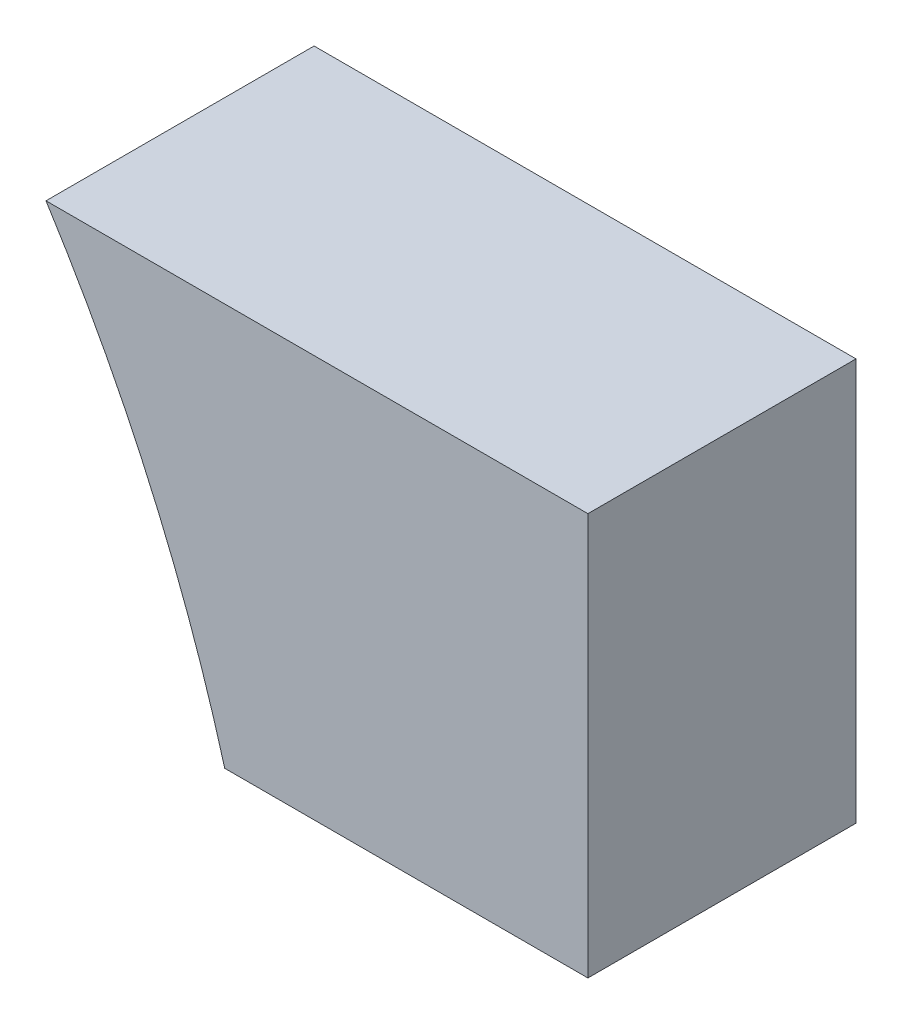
ISO-10303-21;
HEADER;
FILE_DESCRIPTION(('STEP AP214'),'2;1');
FILE_NAME('part.step','',(''),(''),'','','');
FILE_SCHEMA(('AUTOMOTIVE_DESIGN { 1 0 10303 214 1 1 1 1 }'));
ENDSEC;
DATA;
#1=APPLICATION_CONTEXT('core data for automotive mechanical design processes');
#2=APPLICATION_PROTOCOL_DEFINITION('international standard','automotive_design',2000,#1);
#3=PRODUCT_CONTEXT('',#1,'mechanical');
#4=PRODUCT('Part','Part','',(#3));
#5=PRODUCT_RELATED_PRODUCT_CATEGORY('part','',(#4));
#6=PRODUCT_DEFINITION_FORMATION('','',#4);
#7=PRODUCT_DEFINITION_CONTEXT('part definition',#1,'design');
#8=PRODUCT_DEFINITION('design','',#6,#7);
#9=PRODUCT_DEFINITION_SHAPE('','',#8);
#10=(LENGTH_UNIT() NAMED_UNIT(*) SI_UNIT(.MILLI.,.METRE.));
#11=(NAMED_UNIT(*) PLANE_ANGLE_UNIT() SI_UNIT($,.RADIAN.));
#12=(NAMED_UNIT(*) SI_UNIT($,.STERADIAN.) SOLID_ANGLE_UNIT());
#13=UNCERTAINTY_MEASURE_WITH_UNIT(LENGTH_MEASURE(1.E-05),#10,'distance_accuracy_value','');
#14=(GEOMETRIC_REPRESENTATION_CONTEXT(3) GLOBAL_UNCERTAINTY_ASSIGNED_CONTEXT((#13)) GLOBAL_UNIT_ASSIGNED_CONTEXT((#10,
#11,#12)) REPRESENTATION_CONTEXT('',''));
#15=CARTESIAN_POINT('',(0.,0.,0.));
#16=DIRECTION('',(0.,0.,1.));
#17=DIRECTION('',(1.,0.,0.));
#18=AXIS2_PLACEMENT_3D('',#15,#16,#17);
#19=CARTESIAN_POINT('',(0.,0.,20.));
#20=DIRECTION('',(0.,0.,-1.));
#21=DIRECTION('',(-1.,0.,0.));
#22=AXIS2_PLACEMENT_3D('',#19,#20,#21);
#23=CYLINDRICAL_SURFACE('',#22,112.);
#24=CARTESIAN_POINT('',(0.,0.,0.));
#25=DIRECTION('',(0.,0.,-1.));
#26=DIRECTION('',(1.,0.,0.));
#27=AXIS2_PLACEMENT_3D('',#24,#25,#26);
#28=CIRCLE('',#27,112.);
#29=CARTESIAN_POINT('',(94.5727233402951,60.,0.));
#30=VERTEX_POINT('',#29);
#31=CARTESIAN_POINT('',(107.90736768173,30.,0.));
#32=VERTEX_POINT('',#31);
#33=EDGE_CURVE('E70',#30,#32,#28,.T.);
#34=ORIENTED_EDGE('',*,*,#33,.T.);
#35=DIRECTION('',(0.,0.,-1.));
#36=VECTOR('',#35,1.);
#37=CARTESIAN_POINT('',(107.90736768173,30.,20.));
#38=LINE('',#37,#36);
#39=CARTESIAN_POINT('',(107.90736768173,30.,20.));
#40=VERTEX_POINT('',#39);
#41=EDGE_CURVE('E11',#40,#32,#38,.T.);
#42=ORIENTED_EDGE('',*,*,#41,.F.);
#43=CARTESIAN_POINT('',(0.,0.,20.));
#44=DIRECTION('',(0.,0.,-1.));
#45=DIRECTION('',(1.,0.,0.));
#46=AXIS2_PLACEMENT_3D('',#43,#44,#45);
#47=CIRCLE('',#46,112.);
#48=CARTESIAN_POINT('',(94.5727233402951,60.,20.));
#49=VERTEX_POINT('',#48);
#50=EDGE_CURVE('E88',#49,#40,#47,.T.);
#51=ORIENTED_EDGE('',*,*,#50,.F.);
#52=DIRECTION('',(0.,0.,-1.));
#53=VECTOR('',#52,1.);
#54=CARTESIAN_POINT('',(94.5727233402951,60.,20.));
#55=LINE('',#54,#53);
#56=EDGE_CURVE('E82',#49,#30,#55,.T.);
#57=ORIENTED_EDGE('',*,*,#56,.T.);
#58=EDGE_LOOP('',(#34,#42,#51,#57));
#59=FACE_BOUND('',#58,.T.);
#60=ADVANCED_FACE('F26',(#59),#23,.F.);
#61=CARTESIAN_POINT('',(135.,30.,20.));
#62=DIRECTION('',(0.,1.,0.));
#63=DIRECTION('',(-1.,0.,0.));
#64=AXIS2_PLACEMENT_3D('',#61,#62,#63);
#65=PLANE('',#64);
#66=DIRECTION('',(1.,0.,0.));
#67=VECTOR('',#66,1.);
#68=CARTESIAN_POINT('',(135.,30.,0.));
#69=LINE('',#68,#67);
#70=CARTESIAN_POINT('',(135.,30.,0.));
#71=VERTEX_POINT('',#70);
#72=EDGE_CURVE('E66',#32,#71,#69,.T.);
#73=ORIENTED_EDGE('',*,*,#72,.T.);
#74=DIRECTION('',(0.,0.,-1.));
#75=VECTOR('',#74,1.);
#76=CARTESIAN_POINT('',(135.,30.,20.));
#77=LINE('',#76,#75);
#78=CARTESIAN_POINT('',(135.,30.,20.));
#79=VERTEX_POINT('',#78);
#80=EDGE_CURVE('E33',#79,#71,#77,.T.);
#81=ORIENTED_EDGE('',*,*,#80,.F.);
#82=DIRECTION('',(1.,0.,0.));
#83=VECTOR('',#82,1.);
#84=CARTESIAN_POINT('',(135.,30.,20.));
#85=LINE('',#84,#83);
#86=EDGE_CURVE('E78',#40,#79,#85,.T.);
#87=ORIENTED_EDGE('',*,*,#86,.F.);
#88=ORIENTED_EDGE('',*,*,#41,.T.);
#89=EDGE_LOOP('',(#73,#81,#87,#88));
#90=FACE_BOUND('',#89,.T.);
#91=ADVANCED_FACE('F77',(#90),#65,.F.);
#92=CARTESIAN_POINT('',(135.,60.,20.));
#93=DIRECTION('',(-1.,0.,0.));
#94=DIRECTION('',(0.,0.,1.));
#95=AXIS2_PLACEMENT_3D('',#92,#93,#94);
#96=PLANE('',#95);
#97=DIRECTION('',(0.,1.,0.));
#98=VECTOR('',#97,1.);
#99=CARTESIAN_POINT('',(135.,60.,0.));
#100=LINE('',#99,#98);
#101=CARTESIAN_POINT('',(135.,60.,0.));
#102=VERTEX_POINT('',#101);
#103=EDGE_CURVE('E71',#71,#102,#100,.T.);
#104=ORIENTED_EDGE('',*,*,#103,.T.);
#105=DIRECTION('',(0.,0.,-1.));
#106=VECTOR('',#105,1.);
#107=CARTESIAN_POINT('',(135.,60.,20.));
#108=LINE('',#107,#106);
#109=CARTESIAN_POINT('',(135.,60.,20.));
#110=VERTEX_POINT('',#109);
#111=EDGE_CURVE('E94',#110,#102,#108,.T.);
#112=ORIENTED_EDGE('',*,*,#111,.F.);
#113=DIRECTION('',(0.,1.,0.));
#114=VECTOR('',#113,1.);
#115=CARTESIAN_POINT('',(135.,60.,20.));
#116=LINE('',#115,#114);
#117=EDGE_CURVE('E45',#79,#110,#116,.T.);
#118=ORIENTED_EDGE('',*,*,#117,.F.);
#119=ORIENTED_EDGE('',*,*,#80,.T.);
#120=EDGE_LOOP('',(#104,#112,#118,#119));
#121=FACE_BOUND('',#120,.T.);
#122=ADVANCED_FACE('F97',(#121),#96,.F.);
#123=CARTESIAN_POINT('',(94.5727233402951,60.,20.));
#124=DIRECTION('',(0.,-1.,0.));
#125=DIRECTION('',(0.,0.,-1.));
#126=AXIS2_PLACEMENT_3D('',#123,#124,#125);
#127=PLANE('',#126);
#128=DIRECTION('',(-1.,0.,0.));
#129=VECTOR('',#128,1.);
#130=CARTESIAN_POINT('',(94.5727233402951,60.,0.));
#131=LINE('',#130,#129);
#132=EDGE_CURVE('E86',#102,#30,#131,.T.);
#133=ORIENTED_EDGE('',*,*,#132,.T.);
#134=ORIENTED_EDGE('',*,*,#56,.F.);
#135=DIRECTION('',(-1.,0.,0.));
#136=VECTOR('',#135,1.);
#137=CARTESIAN_POINT('',(94.5727233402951,60.,20.));
#138=LINE('',#137,#136);
#139=EDGE_CURVE('E40',#110,#49,#138,.T.);
#140=ORIENTED_EDGE('',*,*,#139,.F.);
#141=ORIENTED_EDGE('',*,*,#111,.T.);
#142=EDGE_LOOP('',(#133,#134,#140,#141));
#143=FACE_BOUND('',#142,.T.);
#144=ADVANCED_FACE('F99',(#143),#127,.F.);
#145=CARTESIAN_POINT('',(0.,0.,20.));
#146=DIRECTION('',(0.,0.,1.));
#147=DIRECTION('',(1.,0.,0.));
#148=AXIS2_PLACEMENT_3D('',#145,#146,#147);
#149=PLANE('',#148);
#150=ORIENTED_EDGE('',*,*,#50,.T.);
#151=ORIENTED_EDGE('',*,*,#86,.T.);
#152=ORIENTED_EDGE('',*,*,#117,.T.);
#153=ORIENTED_EDGE('',*,*,#139,.T.);
#154=EDGE_LOOP('',(#150,#151,#152,#153));
#155=FACE_BOUND('',#154,.T.);
#156=ADVANCED_FACE('F100',(#155),#149,.T.);
#157=CARTESIAN_POINT('',(0.,0.,0.));
#158=DIRECTION('',(0.,0.,1.));
#159=DIRECTION('',(1.,0.,0.));
#160=AXIS2_PLACEMENT_3D('',#157,#158,#159);
#161=PLANE('',#160);
#162=ORIENTED_EDGE('',*,*,#33,.F.);
#163=ORIENTED_EDGE('',*,*,#132,.F.);
#164=ORIENTED_EDGE('',*,*,#103,.F.);
#165=ORIENTED_EDGE('',*,*,#72,.F.);
#166=EDGE_LOOP('',(#162,#163,#164,#165));
#167=FACE_BOUND('',#166,.T.);
#168=ADVANCED_FACE('F67',(#167),#161,.F.);
#169=CLOSED_SHELL('',(#60,#91,#122,#144,#156,#168));
#170=MANIFOLD_SOLID_BREP('B2',#169);
#171=ADVANCED_BREP_SHAPE_REPRESENTATION('',(#18,#170),#14);
#172=SHAPE_DEFINITION_REPRESENTATION(#9,#171);
ENDSEC;
END-ISO-10303-21;
